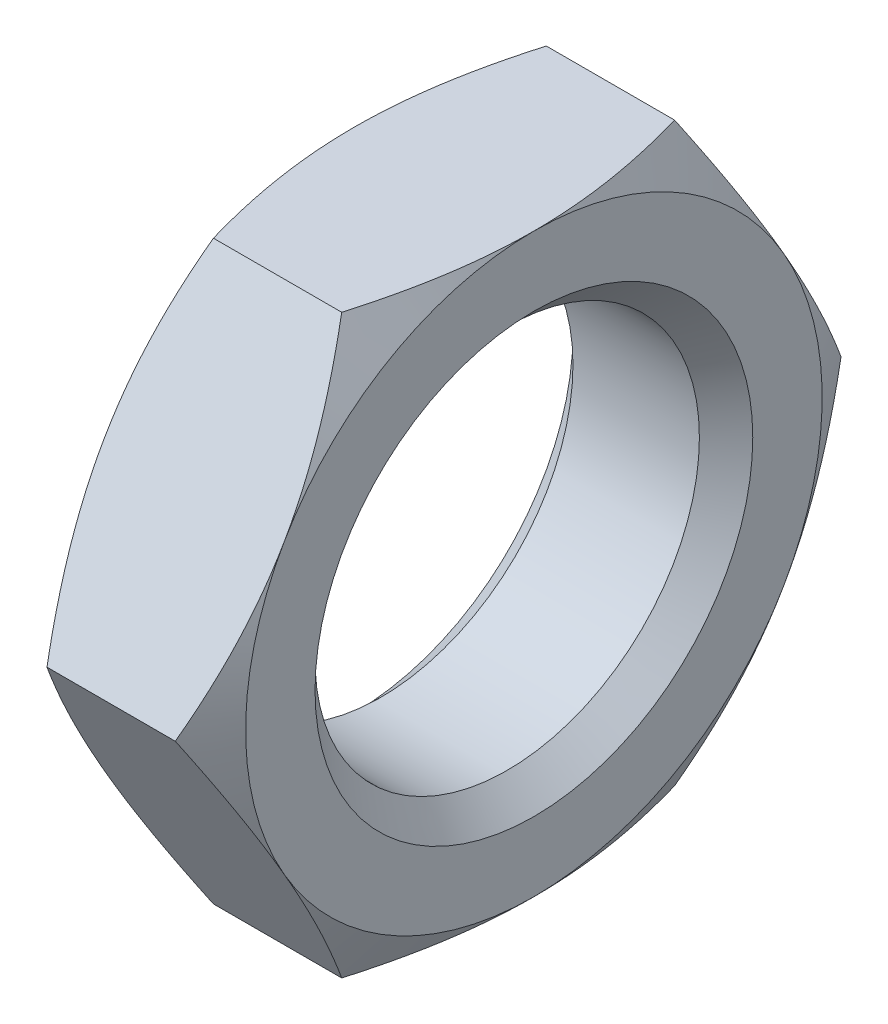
from build123d import *

# Parameters (mm, degrees)
SKETCH1_R      = 9
EXTRUDE1_DEPTH = 8.42
CHAMFER1_SIZE  = 1.25


with BuildPart() as part:
    # Sketch1 → Extrude1 (new body)
    with BuildSketch(Plane(origin=(0, 0, 0), x_dir=(0, 0, -1), z_dir=(1, 0, 0))):
        Polygon((7.794228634, 13.5), (-7.794228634, 13.5), (-15.588457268, 0), (-7.794228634, -13.5), (7.794228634, -13.5), (15.588457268, 0), align=None)
        Circle(SKETCH1_R, mode=Mode.SUBTRACT)
    extrude(amount=EXTRUDE1_DEPTH)

    # Sketch2 → Cut-Revolve1 (revolve, cut)
    with BuildSketch(Plane.XY):
        Polygon((8.42, 13.5), (8.42, 54), (0, 54), (0, 13.5), (4.21, 20.7919339), align=None)
    revolve(axis=Axis((8.42, 0, 0), (-1, 0, 0)), mode=Mode.SUBTRACT)

    # Chamfer1
    chamfer1_edges = [part.edges().sort_by_distance(p)[0] for p in [
        (0, 0, 9),
        (8.42, 0, 9),
    ]]
    chamfer(chamfer1_edges, length=CHAMFER1_SIZE)


solid = part.part
